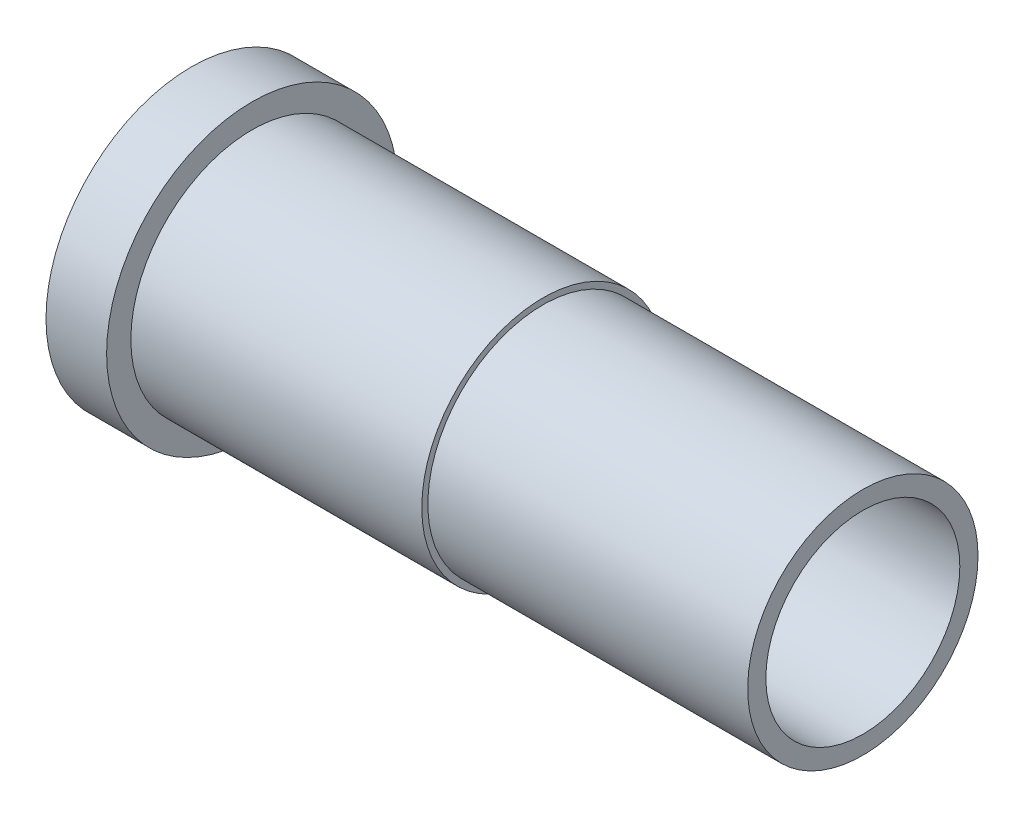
from build123d import *

# Parameters (mm, degrees)
CHANFREIN1_SIZE         = 0.5
ESQUISSE2_OUTSIDE_W     = 39.614
ESQUISSE2_OUTSIDE_H     = 39.614
ESQUISSE2_OUTSIDE_R     = 9.5
ENL_V_MAT_EXTRU_1_DEPTH = 30
ENL_V_START             = -3.617
ESQUISSE3_R             = 9.5
ENL_V_MAT_EXTRU_2_DEPTH = 3.617


with BuildPart() as part:
    # Esquisse1 → R_volution1 (revolve)
    with BuildSketch(Plane.XY, mode=Mode.PRIVATE) as r_volution1_sk:
        Polygon((0, 8), (0, 12), (5, 12), (5, 10), (59, 10), (59, 8), align=None)
    revolve(r_volution1_sk.sketch.rotate(Axis((-21.639335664, 0, 0), (1, 0, 0)), 90), axis=Axis((-21.639335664, 0, 0), (1, 0, 0)))

    # Chanfrein1
    chanfrein1_edges = [part.edges().sort_by_distance(p)[0] for p in [
        (0, 0, -8),
    ]]
    chamfer(chanfrein1_edges, length=CHANFREIN1_SIZE)

    # Esquisse2 outside → Enl_v. mat.-Extru.1 (cut)
    with BuildSketch(Plane(origin=(59, 0, 0), x_dir=(0, 0, -1), z_dir=(1, 0, 0))):
        Rectangle(ESQUISSE2_OUTSIDE_W, ESQUISSE2_OUTSIDE_H)
        Circle(ESQUISSE2_OUTSIDE_R, mode=Mode.SUBTRACT)
    extrude(amount=-ENL_V_MAT_EXTRU_1_DEPTH, mode=Mode.SUBTRACT)

    # Esquisse3 → Enl_v. mat.-Extru.2 (cut)
    with BuildSketch(Plane(origin=(59, 0, 0), x_dir=(0, 0, -1), z_dir=(1, 0, 0)).offset(ENL_V_START)):
        Circle(ESQUISSE3_R)
    extrude(amount=ENL_V_MAT_EXTRU_2_DEPTH, mode=Mode.SUBTRACT)


solid = part.part
